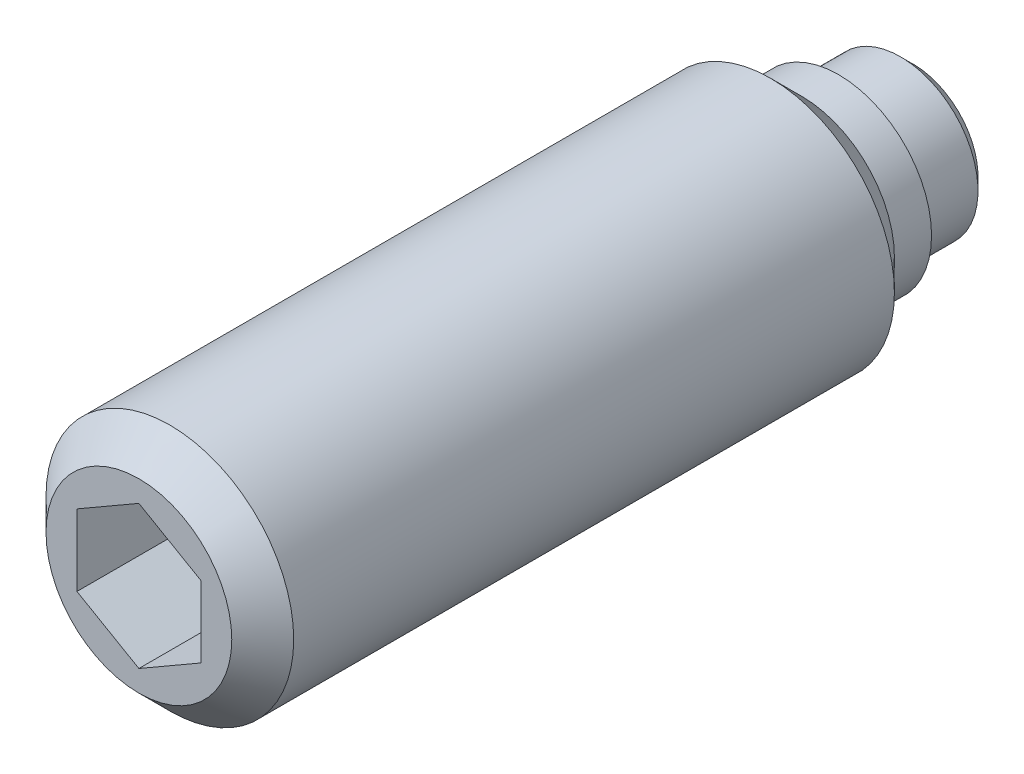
ISO-10303-21;
HEADER;
FILE_DESCRIPTION(('STEP AP214'),'2;1');
FILE_NAME('part.step','',(''),(''),'','','');
FILE_SCHEMA(('AUTOMOTIVE_DESIGN { 1 0 10303 214 1 1 1 1 }'));
ENDSEC;
DATA;
#1=APPLICATION_CONTEXT('core data for automotive mechanical design processes');
#2=APPLICATION_PROTOCOL_DEFINITION('international standard','automotive_design',2000,#1);
#3=PRODUCT_CONTEXT('',#1,'mechanical');
#4=PRODUCT('Part','Part','',(#3));
#5=PRODUCT_RELATED_PRODUCT_CATEGORY('part','',(#4));
#6=PRODUCT_DEFINITION_FORMATION('','',#4);
#7=PRODUCT_DEFINITION_CONTEXT('part definition',#1,'design');
#8=PRODUCT_DEFINITION('design','',#6,#7);
#9=PRODUCT_DEFINITION_SHAPE('','',#8);
#10=(LENGTH_UNIT() NAMED_UNIT(*) SI_UNIT(.MILLI.,.METRE.));
#11=(NAMED_UNIT(*) PLANE_ANGLE_UNIT() SI_UNIT($,.RADIAN.));
#12=(NAMED_UNIT(*) SI_UNIT($,.STERADIAN.) SOLID_ANGLE_UNIT());
#13=UNCERTAINTY_MEASURE_WITH_UNIT(LENGTH_MEASURE(1.E-05),#10,'distance_accuracy_value','');
#14=(GEOMETRIC_REPRESENTATION_CONTEXT(3) GLOBAL_UNCERTAINTY_ASSIGNED_CONTEXT((#13)) GLOBAL_UNIT_ASSIGNED_CONTEXT((#10,
#11,#12)) REPRESENTATION_CONTEXT('',''));
#15=CARTESIAN_POINT('',(0.,0.,0.));
#16=DIRECTION('',(0.,0.,1.));
#17=DIRECTION('',(1.,0.,0.));
#18=AXIS2_PLACEMENT_3D('',#15,#16,#17);
#19=CARTESIAN_POINT('',(0.,0.,1.2));
#20=DIRECTION('',(0.,0.,-1.));
#21=DIRECTION('',(-1.,0.,0.));
#22=AXIS2_PLACEMENT_3D('',#19,#20,#21);
#23=CYLINDRICAL_SURFACE('',#22,2.);
#24=CARTESIAN_POINT('',(0.,0.,12.));
#25=DIRECTION('',(0.,0.,1.));
#26=DIRECTION('',(1.,0.,0.));
#27=AXIS2_PLACEMENT_3D('',#24,#25,#26);
#28=CIRCLE('',#27,2.);
#29=CARTESIAN_POINT('',(2.,0.,12.));
#30=VERTEX_POINT('',#29);
#31=EDGE_CURVE('E9',#30,#30,#28,.F.);
#32=ORIENTED_EDGE('',*,*,#31,.T.);
#33=EDGE_LOOP('',(#32));
#34=FACE_BOUND('',#33,.T.);
#35=CARTESIAN_POINT('',(0.,0.,2.3));
#36=DIRECTION('',(0.,0.,-1.));
#37=DIRECTION('',(-1.,0.,0.));
#38=AXIS2_PLACEMENT_3D('',#35,#36,#37);
#39=CIRCLE('',#38,2.);
#40=CARTESIAN_POINT('',(-2.,0.,2.3));
#41=VERTEX_POINT('',#40);
#42=EDGE_CURVE('E136',#41,#41,#39,.T.);
#43=ORIENTED_EDGE('',*,*,#42,.F.);
#44=EDGE_LOOP('',(#43));
#45=FACE_BOUND('',#44,.T.);
#46=ADVANCED_FACE('F14',(#34,#45),#23,.T.);
#47=CARTESIAN_POINT('',(0.,0.,2.3));
#48=DIRECTION('',(0.,0.,1.));
#49=DIRECTION('',(1.,0.,0.));
#50=AXIS2_PLACEMENT_3D('',#47,#48,#49);
#51=CONICAL_SURFACE('',#50,2.,0.785398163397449);
#52=ORIENTED_EDGE('',*,*,#42,.T.);
#53=EDGE_LOOP('',(#52));
#54=FACE_BOUND('',#53,.T.);
#55=CARTESIAN_POINT('',(0.,0.,1.8));
#56=DIRECTION('',(0.,0.,-1.));
#57=DIRECTION('',(-1.,0.,0.));
#58=AXIS2_PLACEMENT_3D('',#55,#56,#57);
#59=CIRCLE('',#58,1.5);
#60=CARTESIAN_POINT('',(-1.5,0.,1.8));
#61=VERTEX_POINT('',#60);
#62=EDGE_CURVE('E133',#61,#61,#59,.T.);
#63=ORIENTED_EDGE('',*,*,#62,.F.);
#64=EDGE_LOOP('',(#63));
#65=FACE_BOUND('',#64,.T.);
#66=ADVANCED_FACE('F158',(#54,#65),#51,.T.);
#67=CARTESIAN_POINT('',(0.,0.,1.2));
#68=DIRECTION('',(0.,0.,-1.));
#69=DIRECTION('',(-1.,0.,0.));
#70=AXIS2_PLACEMENT_3D('',#67,#68,#69);
#71=CYLINDRICAL_SURFACE('',#70,1.5);
#72=CARTESIAN_POINT('',(0.,0.,1.2));
#73=DIRECTION('',(0.,0.,-1.));
#74=DIRECTION('',(-1.,0.,0.));
#75=AXIS2_PLACEMENT_3D('',#72,#73,#74);
#76=CIRCLE('',#75,1.5);
#77=CARTESIAN_POINT('',(-1.5,0.,1.2));
#78=VERTEX_POINT('',#77);
#79=EDGE_CURVE('E130',#78,#78,#76,.T.);
#80=ORIENTED_EDGE('',*,*,#79,.F.);
#81=EDGE_LOOP('',(#80));
#82=FACE_BOUND('',#81,.T.);
#83=ORIENTED_EDGE('',*,*,#62,.T.);
#84=EDGE_LOOP('',(#83));
#85=FACE_BOUND('',#84,.T.);
#86=ADVANCED_FACE('F163',(#82,#85),#71,.T.);
#87=CARTESIAN_POINT('',(0.,1.5,1.2));
#88=DIRECTION('',(0.,0.,1.));
#89=DIRECTION('',(1.,0.,0.));
#90=AXIS2_PLACEMENT_3D('',#87,#88,#89);
#91=PLANE('',#90);
#92=CARTESIAN_POINT('',(0.,0.,1.2));
#93=DIRECTION('',(0.,0.,-1.));
#94=DIRECTION('',(-1.,0.,0.));
#95=AXIS2_PLACEMENT_3D('',#92,#93,#94);
#96=CIRCLE('',#95,1.25);
#97=CARTESIAN_POINT('',(-1.25,0.,1.2));
#98=VERTEX_POINT('',#97);
#99=EDGE_CURVE('E127',#98,#98,#96,.T.);
#100=ORIENTED_EDGE('',*,*,#99,.F.);
#101=EDGE_LOOP('',(#100));
#102=FACE_BOUND('',#101,.T.);
#103=ORIENTED_EDGE('',*,*,#79,.T.);
#104=EDGE_LOOP('',(#103));
#105=FACE_BOUND('',#104,.T.);
#106=ADVANCED_FACE('F170',(#102,#105),#91,.F.);
#107=CARTESIAN_POINT('',(0.,0.,0.));
#108=DIRECTION('',(0.,0.,-1.));
#109=DIRECTION('',(-1.,0.,0.));
#110=AXIS2_PLACEMENT_3D('',#107,#108,#109);
#111=CYLINDRICAL_SURFACE('',#110,1.25);
#112=CARTESIAN_POINT('',(0.,0.,0.2));
#113=DIRECTION('',(0.,0.,-1.));
#114=DIRECTION('',(-1.,0.,0.));
#115=AXIS2_PLACEMENT_3D('',#112,#113,#114);
#116=CIRCLE('',#115,1.25);
#117=CARTESIAN_POINT('',(-1.25,0.,0.2));
#118=VERTEX_POINT('',#117);
#119=EDGE_CURVE('E124',#118,#118,#116,.T.);
#120=ORIENTED_EDGE('',*,*,#119,.F.);
#121=EDGE_LOOP('',(#120));
#122=FACE_BOUND('',#121,.T.);
#123=ORIENTED_EDGE('',*,*,#99,.T.);
#124=EDGE_LOOP('',(#123));
#125=FACE_BOUND('',#124,.T.);
#126=ADVANCED_FACE('F174',(#122,#125),#111,.T.);
#127=CARTESIAN_POINT('',(0.,0.,0.2));
#128=DIRECTION('',(0.,0.,1.));
#129=DIRECTION('',(1.,0.,0.));
#130=AXIS2_PLACEMENT_3D('',#127,#128,#129);
#131=CONICAL_SURFACE('',#130,1.25,0.785398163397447);
#132=CARTESIAN_POINT('',(0.,0.,0.));
#133=DIRECTION('',(0.,0.,-1.));
#134=DIRECTION('',(-1.,0.,0.));
#135=AXIS2_PLACEMENT_3D('',#132,#133,#134);
#136=CIRCLE('',#135,1.05);
#137=CARTESIAN_POINT('',(-1.05,0.,0.));
#138=VERTEX_POINT('',#137);
#139=EDGE_CURVE('E116',#138,#138,#136,.T.);
#140=ORIENTED_EDGE('',*,*,#139,.F.);
#141=EDGE_LOOP('',(#140));
#142=FACE_BOUND('',#141,.T.);
#143=ORIENTED_EDGE('',*,*,#119,.T.);
#144=EDGE_LOOP('',(#143));
#145=FACE_BOUND('',#144,.T.);
#146=ADVANCED_FACE('F178',(#142,#145),#131,.T.);
#147=CARTESIAN_POINT('',(0.,1.05,0.));
#148=DIRECTION('',(0.,0.,1.));
#149=DIRECTION('',(1.,0.,0.));
#150=AXIS2_PLACEMENT_3D('',#147,#148,#149);
#151=PLANE('',#150);
#152=ORIENTED_EDGE('',*,*,#139,.T.);
#153=EDGE_LOOP('',(#152));
#154=FACE_BOUND('',#153,.T.);
#155=ADVANCED_FACE('F153',(#154),#151,.F.);
#156=CARTESIAN_POINT('',(0.,0.,12.5));
#157=DIRECTION('',(0.,0.,1.));
#158=DIRECTION('',(1.,0.,0.));
#159=AXIS2_PLACEMENT_3D('',#156,#157,#158);
#160=PLANE('',#159);
#161=DIRECTION('',(0.866025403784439,-0.5,0.));
#162=VECTOR('',#161,1.);
#163=CARTESIAN_POINT('',(-1.,-0.577350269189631,12.5));
#164=LINE('',#163,#162);
#165=CARTESIAN_POINT('',(-1.,-0.577350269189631,12.5));
#166=VERTEX_POINT('',#165);
#167=CARTESIAN_POINT('',(0.,-1.15470053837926,12.5));
#168=VERTEX_POINT('',#167);
#169=EDGE_CURVE('E29',#166,#168,#164,.T.);
#170=ORIENTED_EDGE('',*,*,#169,.F.);
#171=DIRECTION('',(0.,-1.,0.));
#172=VECTOR('',#171,1.);
#173=CARTESIAN_POINT('',(-1.,0.577350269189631,12.5));
#174=LINE('',#173,#172);
#175=CARTESIAN_POINT('',(-1.,0.577350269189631,12.5));
#176=VERTEX_POINT('',#175);
#177=EDGE_CURVE('E112',#176,#166,#174,.T.);
#178=ORIENTED_EDGE('',*,*,#177,.F.);
#179=DIRECTION('',(-0.866025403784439,-0.5,0.));
#180=VECTOR('',#179,1.);
#181=CARTESIAN_POINT('',(0.,1.15470053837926,12.5));
#182=LINE('',#181,#180);
#183=CARTESIAN_POINT('',(0.,1.15470053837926,12.5));
#184=VERTEX_POINT('',#183);
#185=EDGE_CURVE('E110',#184,#176,#182,.T.);
#186=ORIENTED_EDGE('',*,*,#185,.F.);
#187=DIRECTION('',(-0.866025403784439,0.5,0.));
#188=VECTOR('',#187,1.);
#189=CARTESIAN_POINT('',(1.,0.577350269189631,12.5));
#190=LINE('',#189,#188);
#191=CARTESIAN_POINT('',(1.,0.577350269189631,12.5));
#192=VERTEX_POINT('',#191);
#193=EDGE_CURVE('E77',#192,#184,#190,.T.);
#194=ORIENTED_EDGE('',*,*,#193,.F.);
#195=DIRECTION('',(0.,1.,0.));
#196=VECTOR('',#195,1.);
#197=CARTESIAN_POINT('',(1.,-0.577350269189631,12.5));
#198=LINE('',#197,#196);
#199=CARTESIAN_POINT('',(1.,-0.577350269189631,12.5));
#200=VERTEX_POINT('',#199);
#201=EDGE_CURVE('E106',#200,#192,#198,.T.);
#202=ORIENTED_EDGE('',*,*,#201,.F.);
#203=DIRECTION('',(0.866025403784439,0.5,0.));
#204=VECTOR('',#203,1.);
#205=CARTESIAN_POINT('',(0.,-1.15470053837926,12.5));
#206=LINE('',#205,#204);
#207=EDGE_CURVE('E103',#168,#200,#206,.T.);
#208=ORIENTED_EDGE('',*,*,#207,.F.);
#209=EDGE_LOOP('',(#170,#178,#186,#194,#202,#208));
#210=FACE_BOUND('',#209,.T.);
#211=CARTESIAN_POINT('',(0.,0.,12.5));
#212=DIRECTION('',(0.,0.,1.));
#213=DIRECTION('',(1.,0.,0.));
#214=AXIS2_PLACEMENT_3D('',#211,#212,#213);
#215=CIRCLE('',#214,1.5);
#216=CARTESIAN_POINT('',(1.5,0.,12.5));
#217=VERTEX_POINT('',#216);
#218=EDGE_CURVE('E22',#217,#217,#215,.T.);
#219=ORIENTED_EDGE('',*,*,#218,.T.);
#220=EDGE_LOOP('',(#219));
#221=FACE_BOUND('',#220,.T.);
#222=ADVANCED_FACE('F141',(#210,#221),#160,.T.);
#223=CARTESIAN_POINT('',(0.,0.,12.5));
#224=DIRECTION('',(0.,0.,-1.));
#225=DIRECTION('',(-1.,0.,0.));
#226=AXIS2_PLACEMENT_3D('',#223,#224,#225);
#227=CONICAL_SURFACE('',#226,1.5,0.785398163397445);
#228=ORIENTED_EDGE('',*,*,#31,.F.);
#229=EDGE_LOOP('',(#228));
#230=FACE_BOUND('',#229,.T.);
#231=ORIENTED_EDGE('',*,*,#218,.F.);
#232=EDGE_LOOP('',(#231));
#233=FACE_BOUND('',#232,.T.);
#234=ADVANCED_FACE('F16',(#230,#233),#227,.T.);
#235=CARTESIAN_POINT('',(-1.,-0.577350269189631,10.));
#236=DIRECTION('',(-0.5,-0.866025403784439,0.));
#237=DIRECTION('',(0.866025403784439,-0.5,0.));
#238=AXIS2_PLACEMENT_3D('',#235,#236,#237);
#239=PLANE('',#238);
#240=ORIENTED_EDGE('',*,*,#169,.T.);
#241=DIRECTION('',(0.,0.,1.));
#242=VECTOR('',#241,1.);
#243=CARTESIAN_POINT('',(0.,-1.15470053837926,10.));
#244=LINE('',#243,#242);
#245=CARTESIAN_POINT('',(0.,-1.15470053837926,10.));
#246=VERTEX_POINT('',#245);
#247=EDGE_CURVE('E59',#246,#168,#244,.T.);
#248=ORIENTED_EDGE('',*,*,#247,.F.);
#249=DIRECTION('',(0.866025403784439,-0.5,0.));
#250=VECTOR('',#249,1.);
#251=CARTESIAN_POINT('',(-1.,-0.577350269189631,10.));
#252=LINE('',#251,#250);
#253=CARTESIAN_POINT('',(-1.,-0.577350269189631,10.));
#254=VERTEX_POINT('',#253);
#255=EDGE_CURVE('E114',#254,#246,#252,.T.);
#256=ORIENTED_EDGE('',*,*,#255,.F.);
#257=DIRECTION('',(0.,0.,1.));
#258=VECTOR('',#257,1.);
#259=CARTESIAN_POINT('',(-1.,-0.577350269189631,10.));
#260=LINE('',#259,#258);
#261=EDGE_CURVE('E37',#254,#166,#260,.T.);
#262=ORIENTED_EDGE('',*,*,#261,.T.);
#263=EDGE_LOOP('',(#240,#248,#256,#262));
#264=FACE_BOUND('',#263,.T.);
#265=ADVANCED_FACE('F144',(#264),#239,.F.);
#266=CARTESIAN_POINT('',(-1.,0.577350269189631,10.));
#267=DIRECTION('',(-1.,0.,0.));
#268=DIRECTION('',(0.,0.,1.));
#269=AXIS2_PLACEMENT_3D('',#266,#267,#268);
#270=PLANE('',#269);
#271=ORIENTED_EDGE('',*,*,#177,.T.);
#272=ORIENTED_EDGE('',*,*,#261,.F.);
#273=DIRECTION('',(0.,-1.,0.));
#274=VECTOR('',#273,1.);
#275=CARTESIAN_POINT('',(-1.,0.577350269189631,10.));
#276=LINE('',#275,#274);
#277=CARTESIAN_POINT('',(-1.,0.577350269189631,10.));
#278=VERTEX_POINT('',#277);
#279=EDGE_CURVE('E89',#278,#254,#276,.T.);
#280=ORIENTED_EDGE('',*,*,#279,.F.);
#281=DIRECTION('',(0.,0.,1.));
#282=VECTOR('',#281,1.);
#283=CARTESIAN_POINT('',(-1.,0.577350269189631,10.));
#284=LINE('',#283,#282);
#285=EDGE_CURVE('E81',#278,#176,#284,.T.);
#286=ORIENTED_EDGE('',*,*,#285,.T.);
#287=EDGE_LOOP('',(#271,#272,#280,#286));
#288=FACE_BOUND('',#287,.T.);
#289=ADVANCED_FACE('F151',(#288),#270,.F.);
#290=CARTESIAN_POINT('',(0.,1.15470053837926,10.));
#291=DIRECTION('',(-0.5,0.866025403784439,0.));
#292=DIRECTION('',(-0.866025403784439,-0.5,0.));
#293=AXIS2_PLACEMENT_3D('',#290,#291,#292);
#294=PLANE('',#293);
#295=ORIENTED_EDGE('',*,*,#185,.T.);
#296=ORIENTED_EDGE('',*,*,#285,.F.);
#297=DIRECTION('',(-0.866025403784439,-0.5,0.));
#298=VECTOR('',#297,1.);
#299=CARTESIAN_POINT('',(0.,1.15470053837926,10.));
#300=LINE('',#299,#298);
#301=CARTESIAN_POINT('',(0.,1.15470053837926,10.));
#302=VERTEX_POINT('',#301);
#303=EDGE_CURVE('E85',#302,#278,#300,.T.);
#304=ORIENTED_EDGE('',*,*,#303,.F.);
#305=DIRECTION('',(0.,0.,1.));
#306=VECTOR('',#305,1.);
#307=CARTESIAN_POINT('',(0.,1.15470053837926,10.));
#308=LINE('',#307,#306);
#309=EDGE_CURVE('E70',#302,#184,#308,.T.);
#310=ORIENTED_EDGE('',*,*,#309,.T.);
#311=EDGE_LOOP('',(#295,#296,#304,#310));
#312=FACE_BOUND('',#311,.T.);
#313=ADVANCED_FACE('F86',(#312),#294,.F.);
#314=CARTESIAN_POINT('',(1.,0.577350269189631,10.));
#315=DIRECTION('',(0.5,0.866025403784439,0.));
#316=DIRECTION('',(-0.866025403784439,0.5,0.));
#317=AXIS2_PLACEMENT_3D('',#314,#315,#316);
#318=PLANE('',#317);
#319=ORIENTED_EDGE('',*,*,#193,.T.);
#320=ORIENTED_EDGE('',*,*,#309,.F.);
#321=DIRECTION('',(-0.866025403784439,0.5,0.));
#322=VECTOR('',#321,1.);
#323=CARTESIAN_POINT('',(1.,0.577350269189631,10.));
#324=LINE('',#323,#322);
#325=CARTESIAN_POINT('',(1.,0.577350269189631,10.));
#326=VERTEX_POINT('',#325);
#327=EDGE_CURVE('E74',#326,#302,#324,.T.);
#328=ORIENTED_EDGE('',*,*,#327,.F.);
#329=DIRECTION('',(0.,0.,1.));
#330=VECTOR('',#329,1.);
#331=CARTESIAN_POINT('',(1.,0.577350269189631,10.));
#332=LINE('',#331,#330);
#333=EDGE_CURVE('E82',#326,#192,#332,.T.);
#334=ORIENTED_EDGE('',*,*,#333,.T.);
#335=EDGE_LOOP('',(#319,#320,#328,#334));
#336=FACE_BOUND('',#335,.T.);
#337=ADVANCED_FACE('F72',(#336),#318,.F.);
#338=CARTESIAN_POINT('',(1.,-0.577350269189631,10.));
#339=DIRECTION('',(1.,0.,0.));
#340=DIRECTION('',(0.,0.,-1.));
#341=AXIS2_PLACEMENT_3D('',#338,#339,#340);
#342=PLANE('',#341);
#343=ORIENTED_EDGE('',*,*,#201,.T.);
#344=ORIENTED_EDGE('',*,*,#333,.F.);
#345=DIRECTION('',(0.,1.,0.));
#346=VECTOR('',#345,1.);
#347=CARTESIAN_POINT('',(1.,-0.577350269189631,10.));
#348=LINE('',#347,#346);
#349=CARTESIAN_POINT('',(1.,-0.577350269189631,10.));
#350=VERTEX_POINT('',#349);
#351=EDGE_CURVE('E95',#350,#326,#348,.T.);
#352=ORIENTED_EDGE('',*,*,#351,.F.);
#353=DIRECTION('',(0.,0.,1.));
#354=VECTOR('',#353,1.);
#355=CARTESIAN_POINT('',(1.,-0.577350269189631,10.));
#356=LINE('',#355,#354);
#357=EDGE_CURVE('E119',#350,#200,#356,.T.);
#358=ORIENTED_EDGE('',*,*,#357,.T.);
#359=EDGE_LOOP('',(#343,#344,#352,#358));
#360=FACE_BOUND('',#359,.T.);
#361=ADVANCED_FACE('F189',(#360),#342,.F.);
#362=CARTESIAN_POINT('',(0.,-1.15470053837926,10.));
#363=DIRECTION('',(0.5,-0.866025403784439,0.));
#364=DIRECTION('',(0.866025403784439,0.5,0.));
#365=AXIS2_PLACEMENT_3D('',#362,#363,#364);
#366=PLANE('',#365);
#367=ORIENTED_EDGE('',*,*,#207,.T.);
#368=ORIENTED_EDGE('',*,*,#357,.F.);
#369=DIRECTION('',(0.866025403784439,0.5,0.));
#370=VECTOR('',#369,1.);
#371=CARTESIAN_POINT('',(0.,-1.15470053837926,10.));
#372=LINE('',#371,#370);
#373=EDGE_CURVE('E97',#246,#350,#372,.T.);
#374=ORIENTED_EDGE('',*,*,#373,.F.);
#375=ORIENTED_EDGE('',*,*,#247,.T.);
#376=EDGE_LOOP('',(#367,#368,#374,#375));
#377=FACE_BOUND('',#376,.T.);
#378=ADVANCED_FACE('F186',(#377),#366,.F.);
#379=CARTESIAN_POINT('',(0.,0.,10.));
#380=DIRECTION('',(0.,0.,1.));
#381=DIRECTION('',(1.,0.,0.));
#382=AXIS2_PLACEMENT_3D('',#379,#380,#381);
#383=PLANE('',#382);
#384=ORIENTED_EDGE('',*,*,#255,.T.);
#385=ORIENTED_EDGE('',*,*,#373,.T.);
#386=ORIENTED_EDGE('',*,*,#351,.T.);
#387=ORIENTED_EDGE('',*,*,#327,.T.);
#388=ORIENTED_EDGE('',*,*,#303,.T.);
#389=ORIENTED_EDGE('',*,*,#279,.T.);
#390=EDGE_LOOP('',(#384,#385,#386,#387,#388,#389));
#391=FACE_BOUND('',#390,.T.);
#392=ADVANCED_FACE('F92',(#391),#383,.T.);
#393=CLOSED_SHELL('',(#46,#66,#86,#106,#126,#146,#155,#222,#234,#265,#289,#313,#337,#361,#378,#392));
#394=MANIFOLD_SOLID_BREP('B1',#393);
#395=ADVANCED_BREP_SHAPE_REPRESENTATION('',(#18,#394),#14);
#396=SHAPE_DEFINITION_REPRESENTATION(#9,#395);
ENDSEC;
END-ISO-10303-21;
